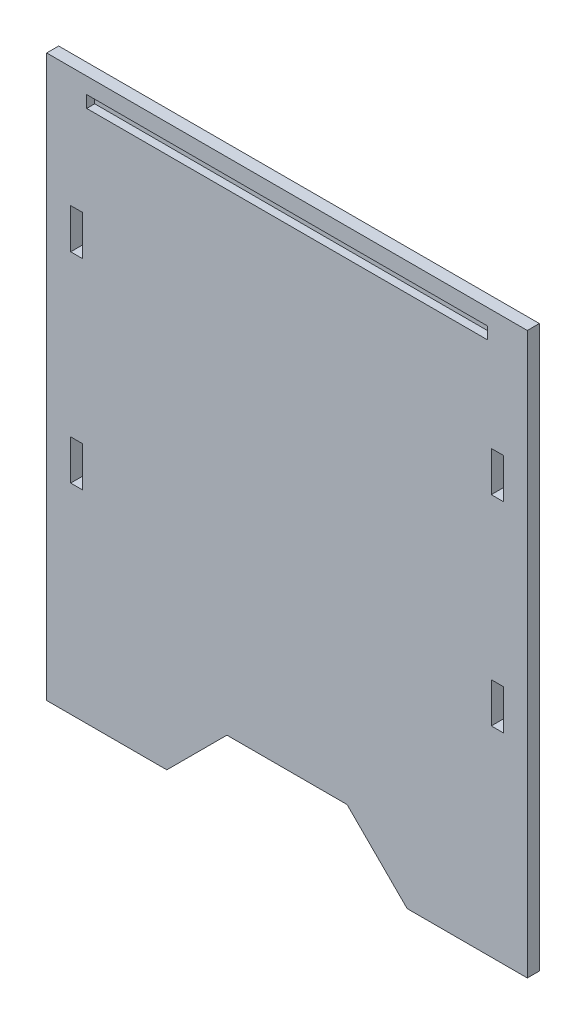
ISO-10303-21;
HEADER;
FILE_DESCRIPTION(('STEP AP214'),'2;1');
FILE_NAME('part.step','',(''),(''),'','','');
FILE_SCHEMA(('AUTOMOTIVE_DESIGN { 1 0 10303 214 1 1 1 1 }'));
ENDSEC;
DATA;
#1=APPLICATION_CONTEXT('core data for automotive mechanical design processes');
#2=APPLICATION_PROTOCOL_DEFINITION('international standard','automotive_design',2000,#1);
#3=PRODUCT_CONTEXT('',#1,'mechanical');
#4=PRODUCT('Part','Part','',(#3));
#5=PRODUCT_RELATED_PRODUCT_CATEGORY('part','',(#4));
#6=PRODUCT_DEFINITION_FORMATION('','',#4);
#7=PRODUCT_DEFINITION_CONTEXT('part definition',#1,'design');
#8=PRODUCT_DEFINITION('design','',#6,#7);
#9=PRODUCT_DEFINITION_SHAPE('','',#8);
#10=(LENGTH_UNIT() NAMED_UNIT(*) SI_UNIT(.MILLI.,.METRE.));
#11=(NAMED_UNIT(*) PLANE_ANGLE_UNIT() SI_UNIT($,.RADIAN.));
#12=(NAMED_UNIT(*) SI_UNIT($,.STERADIAN.) SOLID_ANGLE_UNIT());
#13=UNCERTAINTY_MEASURE_WITH_UNIT(LENGTH_MEASURE(1.E-05),#10,'distance_accuracy_value','');
#14=(GEOMETRIC_REPRESENTATION_CONTEXT(3) GLOBAL_UNCERTAINTY_ASSIGNED_CONTEXT((#13)) GLOBAL_UNIT_ASSIGNED_CONTEXT((#10,
#11,#12)) REPRESENTATION_CONTEXT('',''));
#15=CARTESIAN_POINT('',(0.,0.,0.));
#16=DIRECTION('',(0.,0.,1.));
#17=DIRECTION('',(1.,0.,0.));
#18=AXIS2_PLACEMENT_3D('',#15,#16,#17);
#19=CARTESIAN_POINT('',(300.,-350.,15.));
#20=DIRECTION('',(-1.,0.,0.));
#21=DIRECTION('',(0.,0.,1.));
#22=AXIS2_PLACEMENT_3D('',#19,#20,#21);
#23=PLANE('',#22);
#24=DIRECTION('',(0.,1.,0.));
#25=VECTOR('',#24,1.);
#26=CARTESIAN_POINT('',(300.,-350.,0.));
#27=LINE('',#26,#25);
#28=CARTESIAN_POINT('',(300.,-350.,0.));
#29=VERTEX_POINT('',#28);
#30=CARTESIAN_POINT('',(300.,350.,0.));
#31=VERTEX_POINT('',#30);
#32=EDGE_CURVE('E438',#29,#31,#27,.T.);
#33=ORIENTED_EDGE('',*,*,#32,.T.);
#34=DIRECTION('',(0.,0.,-1.));
#35=VECTOR('',#34,1.);
#36=CARTESIAN_POINT('',(300.,350.,15.));
#37=LINE('',#36,#35);
#38=CARTESIAN_POINT('',(300.,350.,15.));
#39=VERTEX_POINT('',#38);
#40=EDGE_CURVE('E11',#39,#31,#37,.T.);
#41=ORIENTED_EDGE('',*,*,#40,.F.);
#42=DIRECTION('',(0.,1.,0.));
#43=VECTOR('',#42,1.);
#44=CARTESIAN_POINT('',(300.,-350.,15.));
#45=LINE('',#44,#43);
#46=CARTESIAN_POINT('',(300.,-350.,15.));
#47=VERTEX_POINT('',#46);
#48=EDGE_CURVE('E448',#47,#39,#45,.T.);
#49=ORIENTED_EDGE('',*,*,#48,.F.);
#50=DIRECTION('',(0.,0.,-1.));
#51=VECTOR('',#50,1.);
#52=CARTESIAN_POINT('',(300.,-350.,15.));
#53=LINE('',#52,#51);
#54=EDGE_CURVE('E474',#47,#29,#53,.T.);
#55=ORIENTED_EDGE('',*,*,#54,.T.);
#56=EDGE_LOOP('',(#33,#41,#49,#55));
#57=FACE_BOUND('',#56,.T.);
#58=ADVANCED_FACE('F43',(#57),#23,.F.);
#59=CARTESIAN_POINT('',(-300.,350.,15.));
#60=DIRECTION('',(0.,-1.,0.));
#61=DIRECTION('',(0.,0.,-1.));
#62=AXIS2_PLACEMENT_3D('',#59,#60,#61);
#63=PLANE('',#62);
#64=DIRECTION('',(-1.,0.,0.));
#65=VECTOR('',#64,1.);
#66=CARTESIAN_POINT('',(-300.,350.,0.));
#67=LINE('',#66,#65);
#68=CARTESIAN_POINT('',(-300.,350.,0.));
#69=VERTEX_POINT('',#68);
#70=EDGE_CURVE('E478',#31,#69,#67,.T.);
#71=ORIENTED_EDGE('',*,*,#70,.T.);
#72=DIRECTION('',(0.,0.,-1.));
#73=VECTOR('',#72,1.);
#74=CARTESIAN_POINT('',(-300.,350.,15.));
#75=LINE('',#74,#73);
#76=CARTESIAN_POINT('',(-300.,350.,15.));
#77=VERTEX_POINT('',#76);
#78=EDGE_CURVE('E51',#77,#69,#75,.T.);
#79=ORIENTED_EDGE('',*,*,#78,.F.);
#80=DIRECTION('',(-1.,0.,0.));
#81=VECTOR('',#80,1.);
#82=CARTESIAN_POINT('',(-300.,350.,15.));
#83=LINE('',#82,#81);
#84=EDGE_CURVE('E452',#39,#77,#83,.T.);
#85=ORIENTED_EDGE('',*,*,#84,.F.);
#86=ORIENTED_EDGE('',*,*,#40,.T.);
#87=EDGE_LOOP('',(#71,#79,#85,#86));
#88=FACE_BOUND('',#87,.T.);
#89=ADVANCED_FACE('F548',(#88),#63,.F.);
#90=CARTESIAN_POINT('',(-300.,-350.,15.));
#91=DIRECTION('',(1.,0.,0.));
#92=DIRECTION('',(0.,0.,-1.));
#93=AXIS2_PLACEMENT_3D('',#90,#91,#92);
#94=PLANE('',#93);
#95=DIRECTION('',(0.,-1.,0.));
#96=VECTOR('',#95,1.);
#97=CARTESIAN_POINT('',(-300.,-350.,0.));
#98=LINE('',#97,#96);
#99=CARTESIAN_POINT('',(-300.,-350.,0.));
#100=VERTEX_POINT('',#99);
#101=EDGE_CURVE('E481',#69,#100,#98,.T.);
#102=ORIENTED_EDGE('',*,*,#101,.T.);
#103=DIRECTION('',(0.,0.,-1.));
#104=VECTOR('',#103,1.);
#105=CARTESIAN_POINT('',(-300.,-350.,15.));
#106=LINE('',#105,#104);
#107=CARTESIAN_POINT('',(-300.,-350.,15.));
#108=VERTEX_POINT('',#107);
#109=EDGE_CURVE('E517',#108,#100,#106,.T.);
#110=ORIENTED_EDGE('',*,*,#109,.F.);
#111=DIRECTION('',(0.,-1.,0.));
#112=VECTOR('',#111,1.);
#113=CARTESIAN_POINT('',(-300.,-350.,15.));
#114=LINE('',#113,#112);
#115=EDGE_CURVE('E456',#77,#108,#114,.T.);
#116=ORIENTED_EDGE('',*,*,#115,.F.);
#117=ORIENTED_EDGE('',*,*,#78,.T.);
#118=EDGE_LOOP('',(#102,#110,#116,#117));
#119=FACE_BOUND('',#118,.T.);
#120=ADVANCED_FACE('F526',(#119),#94,.F.);
#121=CARTESIAN_POINT('',(-300.,-350.,15.));
#122=DIRECTION('',(0.,1.,0.));
#123=DIRECTION('',(0.,0.,1.));
#124=AXIS2_PLACEMENT_3D('',#121,#122,#123);
#125=PLANE('',#124);
#126=DIRECTION('',(1.,0.,0.));
#127=VECTOR('',#126,1.);
#128=CARTESIAN_POINT('',(-300.,-350.,0.));
#129=LINE('',#128,#127);
#130=CARTESIAN_POINT('',(-150.,-350.,0.));
#131=VERTEX_POINT('',#130);
#132=EDGE_CURVE('E484',#100,#131,#129,.T.);
#133=ORIENTED_EDGE('',*,*,#132,.T.);
#134=DIRECTION('',(0.,0.,-1.));
#135=VECTOR('',#134,1.);
#136=CARTESIAN_POINT('',(-150.,-350.,15.));
#137=LINE('',#136,#135);
#138=CARTESIAN_POINT('',(-150.,-350.,15.));
#139=VERTEX_POINT('',#138);
#140=EDGE_CURVE('E513',#139,#131,#137,.T.);
#141=ORIENTED_EDGE('',*,*,#140,.F.);
#142=DIRECTION('',(1.,0.,0.));
#143=VECTOR('',#142,1.);
#144=CARTESIAN_POINT('',(-300.,-350.,15.));
#145=LINE('',#144,#143);
#146=EDGE_CURVE('E459',#108,#139,#145,.T.);
#147=ORIENTED_EDGE('',*,*,#146,.F.);
#148=ORIENTED_EDGE('',*,*,#109,.T.);
#149=EDGE_LOOP('',(#133,#141,#147,#148));
#150=FACE_BOUND('',#149,.T.);
#151=ADVANCED_FACE('F537',(#150),#125,.F.);
#152=CARTESIAN_POINT('',(-150.,-350.,15.));
#153=DIRECTION('',(-0.707106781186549,0.707106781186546,0.));
#154=DIRECTION('',(-0.707106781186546,-0.707106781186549,0.));
#155=AXIS2_PLACEMENT_3D('',#152,#153,#154);
#156=PLANE('',#155);
#157=DIRECTION('',(0.707106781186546,0.707106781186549,0.));
#158=VECTOR('',#157,1.);
#159=CARTESIAN_POINT('',(-150.,-350.,0.));
#160=LINE('',#159,#158);
#161=CARTESIAN_POINT('',(-75.0000000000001,-275.,0.));
#162=VERTEX_POINT('',#161);
#163=EDGE_CURVE('E487',#131,#162,#160,.T.);
#164=ORIENTED_EDGE('',*,*,#163,.T.);
#165=DIRECTION('',(0.,0.,-1.));
#166=VECTOR('',#165,1.);
#167=CARTESIAN_POINT('',(-75.0000000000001,-275.,15.));
#168=LINE('',#167,#166);
#169=CARTESIAN_POINT('',(-75.0000000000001,-275.,15.));
#170=VERTEX_POINT('',#169);
#171=EDGE_CURVE('E509',#170,#162,#168,.T.);
#172=ORIENTED_EDGE('',*,*,#171,.F.);
#173=DIRECTION('',(0.707106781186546,0.707106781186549,0.));
#174=VECTOR('',#173,1.);
#175=CARTESIAN_POINT('',(-150.,-350.,15.));
#176=LINE('',#175,#174);
#177=EDGE_CURVE('E462',#139,#170,#176,.T.);
#178=ORIENTED_EDGE('',*,*,#177,.F.);
#179=ORIENTED_EDGE('',*,*,#140,.T.);
#180=EDGE_LOOP('',(#164,#172,#178,#179));
#181=FACE_BOUND('',#180,.T.);
#182=ADVANCED_FACE('F541',(#181),#156,.F.);
#183=CARTESIAN_POINT('',(-75.0000000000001,-275.,15.));
#184=DIRECTION('',(0.,1.,0.));
#185=DIRECTION('',(-1.,0.,0.));
#186=AXIS2_PLACEMENT_3D('',#183,#184,#185);
#187=PLANE('',#186);
#188=DIRECTION('',(1.,0.,0.));
#189=VECTOR('',#188,1.);
#190=CARTESIAN_POINT('',(-75.0000000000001,-275.,0.));
#191=LINE('',#190,#189);
#192=CARTESIAN_POINT('',(74.9999999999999,-275.,0.));
#193=VERTEX_POINT('',#192);
#194=EDGE_CURVE('E490',#162,#193,#191,.T.);
#195=ORIENTED_EDGE('',*,*,#194,.T.);
#196=DIRECTION('',(0.,0.,-1.));
#197=VECTOR('',#196,1.);
#198=CARTESIAN_POINT('',(74.9999999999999,-275.,15.));
#199=LINE('',#198,#197);
#200=CARTESIAN_POINT('',(74.9999999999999,-275.,15.));
#201=VERTEX_POINT('',#200);
#202=EDGE_CURVE('E505',#201,#193,#199,.T.);
#203=ORIENTED_EDGE('',*,*,#202,.F.);
#204=DIRECTION('',(1.,0.,0.));
#205=VECTOR('',#204,1.);
#206=CARTESIAN_POINT('',(-75.0000000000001,-275.,15.));
#207=LINE('',#206,#205);
#208=EDGE_CURVE('E465',#170,#201,#207,.T.);
#209=ORIENTED_EDGE('',*,*,#208,.F.);
#210=ORIENTED_EDGE('',*,*,#171,.T.);
#211=EDGE_LOOP('',(#195,#203,#209,#210));
#212=FACE_BOUND('',#211,.T.);
#213=ADVANCED_FACE('F561',(#212),#187,.F.);
#214=CARTESIAN_POINT('',(74.9999999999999,-275.,15.));
#215=DIRECTION('',(0.707106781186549,0.707106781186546,0.));
#216=DIRECTION('',(-0.707106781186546,0.707106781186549,0.));
#217=AXIS2_PLACEMENT_3D('',#214,#215,#216);
#218=PLANE('',#217);
#219=DIRECTION('',(0.707106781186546,-0.707106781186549,0.));
#220=VECTOR('',#219,1.);
#221=CARTESIAN_POINT('',(74.9999999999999,-275.,0.));
#222=LINE('',#221,#220);
#223=CARTESIAN_POINT('',(150.,-350.,0.));
#224=VERTEX_POINT('',#223);
#225=EDGE_CURVE('E493',#193,#224,#222,.T.);
#226=ORIENTED_EDGE('',*,*,#225,.T.);
#227=DIRECTION('',(0.,0.,-1.));
#228=VECTOR('',#227,1.);
#229=CARTESIAN_POINT('',(150.,-350.,15.));
#230=LINE('',#229,#228);
#231=CARTESIAN_POINT('',(150.,-350.,15.));
#232=VERTEX_POINT('',#231);
#233=EDGE_CURVE('E501',#232,#224,#230,.T.);
#234=ORIENTED_EDGE('',*,*,#233,.F.);
#235=DIRECTION('',(0.707106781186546,-0.707106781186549,0.));
#236=VECTOR('',#235,1.);
#237=CARTESIAN_POINT('',(74.9999999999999,-275.,15.));
#238=LINE('',#237,#236);
#239=EDGE_CURVE('E468',#201,#232,#238,.T.);
#240=ORIENTED_EDGE('',*,*,#239,.F.);
#241=ORIENTED_EDGE('',*,*,#202,.T.);
#242=EDGE_LOOP('',(#226,#234,#240,#241));
#243=FACE_BOUND('',#242,.T.);
#244=ADVANCED_FACE('F559',(#243),#218,.F.);
#245=CARTESIAN_POINT('',(150.,-350.,15.));
#246=DIRECTION('',(0.,1.,0.));
#247=DIRECTION('',(0.,0.,1.));
#248=AXIS2_PLACEMENT_3D('',#245,#246,#247);
#249=PLANE('',#248);
#250=DIRECTION('',(1.,0.,0.));
#251=VECTOR('',#250,1.);
#252=CARTESIAN_POINT('',(150.,-350.,0.));
#253=LINE('',#252,#251);
#254=EDGE_CURVE('E453',#224,#29,#253,.T.);
#255=ORIENTED_EDGE('',*,*,#254,.T.);
#256=ORIENTED_EDGE('',*,*,#54,.F.);
#257=DIRECTION('',(1.,0.,0.));
#258=VECTOR('',#257,1.);
#259=CARTESIAN_POINT('',(150.,-350.,15.));
#260=LINE('',#259,#258);
#261=EDGE_CURVE('E471',#232,#47,#260,.T.);
#262=ORIENTED_EDGE('',*,*,#261,.F.);
#263=ORIENTED_EDGE('',*,*,#233,.T.);
#264=EDGE_LOOP('',(#255,#256,#262,#263));
#265=FACE_BOUND('',#264,.T.);
#266=ADVANCED_FACE('F554',(#265),#249,.F.);
#267=CARTESIAN_POINT('',(0.,0.,15.));
#268=DIRECTION('',(0.,0.,-1.));
#269=DIRECTION('',(-1.,0.,0.));
#270=AXIS2_PLACEMENT_3D('',#267,#268,#269);
#271=PLANE('',#270);
#272=DIRECTION('',(-1.,0.,0.));
#273=VECTOR('',#272,1.);
#274=CARTESIAN_POINT('',(255.,-50.,15.));
#275=LINE('',#274,#273);
#276=CARTESIAN_POINT('',(270.,-50.,15.));
#277=VERTEX_POINT('',#276);
#278=CARTESIAN_POINT('',(255.,-50.,15.));
#279=VERTEX_POINT('',#278);
#280=EDGE_CURVE('E301',#277,#279,#275,.T.);
#281=ORIENTED_EDGE('',*,*,#280,.F.);
#282=DIRECTION('',(0.,1.,0.));
#283=VECTOR('',#282,1.);
#284=CARTESIAN_POINT('',(270.,-100.,15.));
#285=LINE('',#284,#283);
#286=CARTESIAN_POINT('',(270.,-100.,15.));
#287=VERTEX_POINT('',#286);
#288=EDGE_CURVE('E58',#287,#277,#285,.T.);
#289=ORIENTED_EDGE('',*,*,#288,.F.);
#290=DIRECTION('',(1.,0.,0.));
#291=VECTOR('',#290,1.);
#292=CARTESIAN_POINT('',(255.,-100.,15.));
#293=LINE('',#292,#291);
#294=CARTESIAN_POINT('',(255.,-100.,15.));
#295=VERTEX_POINT('',#294);
#296=EDGE_CURVE('E292',#295,#287,#293,.T.);
#297=ORIENTED_EDGE('',*,*,#296,.F.);
#298=DIRECTION('',(0.,-1.,0.));
#299=VECTOR('',#298,1.);
#300=CARTESIAN_POINT('',(255.,-100.,15.));
#301=LINE('',#300,#299);
#302=EDGE_CURVE('E296',#279,#295,#301,.T.);
#303=ORIENTED_EDGE('',*,*,#302,.F.);
#304=EDGE_LOOP('',(#281,#289,#297,#303));
#305=FACE_BOUND('',#304,.T.);
#306=DIRECTION('',(1.,0.,0.));
#307=VECTOR('',#306,1.);
#308=CARTESIAN_POINT('',(-255.5,150.,15.));
#309=LINE('',#308,#307);
#310=CARTESIAN_POINT('',(-270.,150.,15.));
#311=VERTEX_POINT('',#310);
#312=CARTESIAN_POINT('',(-255.5,150.,15.));
#313=VERTEX_POINT('',#312);
#314=EDGE_CURVE('E340',#311,#313,#309,.T.);
#315=ORIENTED_EDGE('',*,*,#314,.F.);
#316=DIRECTION('',(0.,-1.,0.));
#317=VECTOR('',#316,1.);
#318=CARTESIAN_POINT('',(-270.,150.,15.));
#319=LINE('',#318,#317);
#320=CARTESIAN_POINT('',(-270.,200.,15.));
#321=VERTEX_POINT('',#320);
#322=EDGE_CURVE('E66',#321,#311,#319,.T.);
#323=ORIENTED_EDGE('',*,*,#322,.F.);
#324=DIRECTION('',(-1.,0.,0.));
#325=VECTOR('',#324,1.);
#326=CARTESIAN_POINT('',(-255.5,200.,15.));
#327=LINE('',#326,#325);
#328=CARTESIAN_POINT('',(-255.5,200.,15.));
#329=VERTEX_POINT('',#328);
#330=EDGE_CURVE('E331',#329,#321,#327,.T.);
#331=ORIENTED_EDGE('',*,*,#330,.F.);
#332=DIRECTION('',(0.,1.,0.));
#333=VECTOR('',#332,1.);
#334=CARTESIAN_POINT('',(-255.5,150.,15.));
#335=LINE('',#334,#333);
#336=EDGE_CURVE('E335',#313,#329,#335,.T.);
#337=ORIENTED_EDGE('',*,*,#336,.F.);
#338=EDGE_LOOP('',(#315,#323,#331,#337));
#339=FACE_BOUND('',#338,.T.);
#340=DIRECTION('',(1.,0.,0.));
#341=VECTOR('',#340,1.);
#342=CARTESIAN_POINT('',(-255.5,-100.,15.));
#343=LINE('',#342,#341);
#344=CARTESIAN_POINT('',(-270.,-100.,15.));
#345=VERTEX_POINT('',#344);
#346=CARTESIAN_POINT('',(-255.5,-100.,15.));
#347=VERTEX_POINT('',#346);
#348=EDGE_CURVE('E254',#345,#347,#343,.T.);
#349=ORIENTED_EDGE('',*,*,#348,.F.);
#350=DIRECTION('',(0.,-1.,0.));
#351=VECTOR('',#350,1.);
#352=CARTESIAN_POINT('',(-270.,-100.,15.));
#353=LINE('',#352,#351);
#354=CARTESIAN_POINT('',(-270.,-50.,15.));
#355=VERTEX_POINT('',#354);
#356=EDGE_CURVE('E231',#355,#345,#353,.T.);
#357=ORIENTED_EDGE('',*,*,#356,.F.);
#358=DIRECTION('',(-1.,0.,0.));
#359=VECTOR('',#358,1.);
#360=CARTESIAN_POINT('',(-255.5,-50.,15.));
#361=LINE('',#360,#359);
#362=CARTESIAN_POINT('',(-255.5,-50.,15.));
#363=VERTEX_POINT('',#362);
#364=EDGE_CURVE('E242',#363,#355,#361,.T.);
#365=ORIENTED_EDGE('',*,*,#364,.F.);
#366=DIRECTION('',(0.,1.,0.));
#367=VECTOR('',#366,1.);
#368=CARTESIAN_POINT('',(-255.5,-100.,15.));
#369=LINE('',#368,#367);
#370=EDGE_CURVE('E248',#347,#363,#369,.T.);
#371=ORIENTED_EDGE('',*,*,#370,.F.);
#372=EDGE_LOOP('',(#349,#357,#365,#371));
#373=FACE_BOUND('',#372,.T.);
#374=DIRECTION('',(-1.,0.,0.));
#375=VECTOR('',#374,1.);
#376=CARTESIAN_POINT('',(255.,200.,15.));
#377=LINE('',#376,#375);
#378=CARTESIAN_POINT('',(270.,200.,15.));
#379=VERTEX_POINT('',#378);
#380=CARTESIAN_POINT('',(255.,200.,15.));
#381=VERTEX_POINT('',#380);
#382=EDGE_CURVE('E380',#379,#381,#377,.T.);
#383=ORIENTED_EDGE('',*,*,#382,.F.);
#384=DIRECTION('',(0.,1.,0.));
#385=VECTOR('',#384,1.);
#386=CARTESIAN_POINT('',(270.,150.,15.));
#387=LINE('',#386,#385);
#388=CARTESIAN_POINT('',(270.,150.,15.));
#389=VERTEX_POINT('',#388);
#390=EDGE_CURVE('E307',#389,#379,#387,.T.);
#391=ORIENTED_EDGE('',*,*,#390,.F.);
#392=DIRECTION('',(1.,0.,0.));
#393=VECTOR('',#392,1.);
#394=CARTESIAN_POINT('',(255.,150.,15.));
#395=LINE('',#394,#393);
#396=CARTESIAN_POINT('',(255.,150.,15.));
#397=VERTEX_POINT('',#396);
#398=EDGE_CURVE('E365',#397,#389,#395,.T.);
#399=ORIENTED_EDGE('',*,*,#398,.F.);
#400=DIRECTION('',(0.,-1.,0.));
#401=VECTOR('',#400,1.);
#402=CARTESIAN_POINT('',(255.,150.,15.));
#403=LINE('',#402,#401);
#404=EDGE_CURVE('E384',#381,#397,#403,.T.);
#405=ORIENTED_EDGE('',*,*,#404,.F.);
#406=EDGE_LOOP('',(#383,#391,#399,#405));
#407=FACE_BOUND('',#406,.T.);
#408=DIRECTION('',(-1.,0.,0.));
#409=VECTOR('',#408,1.);
#410=CARTESIAN_POINT('',(-250.,330.,15.));
#411=LINE('',#410,#409);
#412=CARTESIAN_POINT('',(250.,330.,15.));
#413=VERTEX_POINT('',#412);
#414=CARTESIAN_POINT('',(-250.,330.,15.));
#415=VERTEX_POINT('',#414);
#416=EDGE_CURVE('E424',#413,#415,#411,.T.);
#417=ORIENTED_EDGE('',*,*,#416,.F.);
#418=DIRECTION('',(0.,1.,0.));
#419=VECTOR('',#418,1.);
#420=CARTESIAN_POINT('',(250.,315.,15.));
#421=LINE('',#420,#419);
#422=CARTESIAN_POINT('',(250.,315.,15.));
#423=VERTEX_POINT('',#422);
#424=EDGE_CURVE('E394',#423,#413,#421,.T.);
#425=ORIENTED_EDGE('',*,*,#424,.F.);
#426=DIRECTION('',(1.,0.,0.));
#427=VECTOR('',#426,1.);
#428=CARTESIAN_POINT('',(-250.,315.,15.));
#429=LINE('',#428,#427);
#430=CARTESIAN_POINT('',(-250.,315.,15.));
#431=VERTEX_POINT('',#430);
#432=EDGE_CURVE('E409',#431,#423,#429,.T.);
#433=ORIENTED_EDGE('',*,*,#432,.F.);
#434=DIRECTION('',(0.,-1.,0.));
#435=VECTOR('',#434,1.);
#436=CARTESIAN_POINT('',(-250.,315.,15.));
#437=LINE('',#436,#435);
#438=EDGE_CURVE('E428',#415,#431,#437,.T.);
#439=ORIENTED_EDGE('',*,*,#438,.F.);
#440=EDGE_LOOP('',(#417,#425,#433,#439));
#441=FACE_BOUND('',#440,.T.);
#442=ORIENTED_EDGE('',*,*,#48,.T.);
#443=ORIENTED_EDGE('',*,*,#84,.T.);
#444=ORIENTED_EDGE('',*,*,#115,.T.);
#445=ORIENTED_EDGE('',*,*,#146,.T.);
#446=ORIENTED_EDGE('',*,*,#177,.T.);
#447=ORIENTED_EDGE('',*,*,#208,.T.);
#448=ORIENTED_EDGE('',*,*,#239,.T.);
#449=ORIENTED_EDGE('',*,*,#261,.T.);
#450=EDGE_LOOP('',(#442,#443,#444,#445,#446,#447,#448,#449));
#451=FACE_BOUND('',#450,.T.);
#452=ADVANCED_FACE('F251',(#305,#339,#373,#407,#441,#451),#271,.F.);
#453=CARTESIAN_POINT('',(0.,0.,0.));
#454=DIRECTION('',(0.,0.,-1.));
#455=DIRECTION('',(-1.,0.,0.));
#456=AXIS2_PLACEMENT_3D('',#453,#454,#455);
#457=PLANE('',#456);
#458=DIRECTION('',(0.,1.,0.));
#459=VECTOR('',#458,1.);
#460=CARTESIAN_POINT('',(270.,-100.,0.));
#461=LINE('',#460,#459);
#462=CARTESIAN_POINT('',(270.,-100.,0.));
#463=VERTEX_POINT('',#462);
#464=CARTESIAN_POINT('',(270.,-50.,0.));
#465=VERTEX_POINT('',#464);
#466=EDGE_CURVE('E297',#463,#465,#461,.T.);
#467=ORIENTED_EDGE('',*,*,#466,.T.);
#468=DIRECTION('',(-1.,0.,0.));
#469=VECTOR('',#468,1.);
#470=CARTESIAN_POINT('',(255.,-50.,0.));
#471=LINE('',#470,#469);
#472=CARTESIAN_POINT('',(255.,-50.,0.));
#473=VERTEX_POINT('',#472);
#474=EDGE_CURVE('E315',#465,#473,#471,.T.);
#475=ORIENTED_EDGE('',*,*,#474,.T.);
#476=DIRECTION('',(0.,-1.,0.));
#477=VECTOR('',#476,1.);
#478=CARTESIAN_POINT('',(255.,-100.,0.));
#479=LINE('',#478,#477);
#480=CARTESIAN_POINT('',(255.,-100.,0.));
#481=VERTEX_POINT('',#480);
#482=EDGE_CURVE('E311',#473,#481,#479,.T.);
#483=ORIENTED_EDGE('',*,*,#482,.T.);
#484=DIRECTION('',(1.,0.,0.));
#485=VECTOR('',#484,1.);
#486=CARTESIAN_POINT('',(255.,-100.,0.));
#487=LINE('',#486,#485);
#488=EDGE_CURVE('E282',#481,#463,#487,.T.);
#489=ORIENTED_EDGE('',*,*,#488,.T.);
#490=EDGE_LOOP('',(#467,#475,#483,#489));
#491=FACE_BOUND('',#490,.T.);
#492=DIRECTION('',(0.,-1.,0.));
#493=VECTOR('',#492,1.);
#494=CARTESIAN_POINT('',(-270.,150.,0.));
#495=LINE('',#494,#493);
#496=CARTESIAN_POINT('',(-270.,200.,0.));
#497=VERTEX_POINT('',#496);
#498=CARTESIAN_POINT('',(-270.,150.,0.));
#499=VERTEX_POINT('',#498);
#500=EDGE_CURVE('E336',#497,#499,#495,.T.);
#501=ORIENTED_EDGE('',*,*,#500,.T.);
#502=DIRECTION('',(1.,0.,0.));
#503=VECTOR('',#502,1.);
#504=CARTESIAN_POINT('',(-255.5,150.,0.));
#505=LINE('',#504,#503);
#506=CARTESIAN_POINT('',(-255.5,150.,0.));
#507=VERTEX_POINT('',#506);
#508=EDGE_CURVE('E353',#499,#507,#505,.T.);
#509=ORIENTED_EDGE('',*,*,#508,.T.);
#510=DIRECTION('',(0.,1.,0.));
#511=VECTOR('',#510,1.);
#512=CARTESIAN_POINT('',(-255.5,150.,0.));
#513=LINE('',#512,#511);
#514=CARTESIAN_POINT('',(-255.5,200.,0.));
#515=VERTEX_POINT('',#514);
#516=EDGE_CURVE('E349',#507,#515,#513,.T.);
#517=ORIENTED_EDGE('',*,*,#516,.T.);
#518=DIRECTION('',(-1.,0.,0.));
#519=VECTOR('',#518,1.);
#520=CARTESIAN_POINT('',(-255.5,200.,0.));
#521=LINE('',#520,#519);
#522=EDGE_CURVE('E325',#515,#497,#521,.T.);
#523=ORIENTED_EDGE('',*,*,#522,.T.);
#524=EDGE_LOOP('',(#501,#509,#517,#523));
#525=FACE_BOUND('',#524,.T.);
#526=DIRECTION('',(0.,-1.,0.));
#527=VECTOR('',#526,1.);
#528=CARTESIAN_POINT('',(-270.,-100.,0.));
#529=LINE('',#528,#527);
#530=CARTESIAN_POINT('',(-270.,-50.,0.));
#531=VERTEX_POINT('',#530);
#532=CARTESIAN_POINT('',(-270.,-100.,0.));
#533=VERTEX_POINT('',#532);
#534=EDGE_CURVE('E234',#531,#533,#529,.T.);
#535=ORIENTED_EDGE('',*,*,#534,.T.);
#536=DIRECTION('',(1.,0.,0.));
#537=VECTOR('',#536,1.);
#538=CARTESIAN_POINT('',(-255.5,-100.,0.));
#539=LINE('',#538,#537);
#540=CARTESIAN_POINT('',(-255.5,-100.,0.));
#541=VERTEX_POINT('',#540);
#542=EDGE_CURVE('E273',#533,#541,#539,.T.);
#543=ORIENTED_EDGE('',*,*,#542,.T.);
#544=DIRECTION('',(0.,1.,0.));
#545=VECTOR('',#544,1.);
#546=CARTESIAN_POINT('',(-255.5,-100.,0.));
#547=LINE('',#546,#545);
#548=CARTESIAN_POINT('',(-255.5,-50.,0.));
#549=VERTEX_POINT('',#548);
#550=EDGE_CURVE('E268',#541,#549,#547,.T.);
#551=ORIENTED_EDGE('',*,*,#550,.T.);
#552=DIRECTION('',(-1.,0.,0.));
#553=VECTOR('',#552,1.);
#554=CARTESIAN_POINT('',(-255.5,-50.,0.));
#555=LINE('',#554,#553);
#556=EDGE_CURVE('E265',#549,#531,#555,.T.);
#557=ORIENTED_EDGE('',*,*,#556,.T.);
#558=EDGE_LOOP('',(#535,#543,#551,#557));
#559=FACE_BOUND('',#558,.T.);
#560=DIRECTION('',(0.,1.,0.));
#561=VECTOR('',#560,1.);
#562=CARTESIAN_POINT('',(270.,150.,0.));
#563=LINE('',#562,#561);
#564=CARTESIAN_POINT('',(270.,150.,0.));
#565=VERTEX_POINT('',#564);
#566=CARTESIAN_POINT('',(270.,200.,0.));
#567=VERTEX_POINT('',#566);
#568=EDGE_CURVE('E360',#565,#567,#563,.T.);
#569=ORIENTED_EDGE('',*,*,#568,.T.);
#570=DIRECTION('',(-1.,0.,0.));
#571=VECTOR('',#570,1.);
#572=CARTESIAN_POINT('',(255.,200.,0.));
#573=LINE('',#572,#571);
#574=CARTESIAN_POINT('',(255.,200.,0.));
#575=VERTEX_POINT('',#574);
#576=EDGE_CURVE('E364',#567,#575,#573,.T.);
#577=ORIENTED_EDGE('',*,*,#576,.T.);
#578=DIRECTION('',(0.,-1.,0.));
#579=VECTOR('',#578,1.);
#580=CARTESIAN_POINT('',(255.,150.,0.));
#581=LINE('',#580,#579);
#582=CARTESIAN_POINT('',(255.,150.,0.));
#583=VERTEX_POINT('',#582);
#584=EDGE_CURVE('E369',#575,#583,#581,.T.);
#585=ORIENTED_EDGE('',*,*,#584,.T.);
#586=DIRECTION('',(1.,0.,0.));
#587=VECTOR('',#586,1.);
#588=CARTESIAN_POINT('',(255.,150.,0.));
#589=LINE('',#588,#587);
#590=EDGE_CURVE('E373',#583,#565,#589,.T.);
#591=ORIENTED_EDGE('',*,*,#590,.T.);
#592=EDGE_LOOP('',(#569,#577,#585,#591));
#593=FACE_BOUND('',#592,.T.);
#594=ORIENTED_EDGE('',*,*,#32,.F.);
#595=ORIENTED_EDGE('',*,*,#254,.F.);
#596=ORIENTED_EDGE('',*,*,#225,.F.);
#597=ORIENTED_EDGE('',*,*,#194,.F.);
#598=ORIENTED_EDGE('',*,*,#163,.F.);
#599=ORIENTED_EDGE('',*,*,#132,.F.);
#600=ORIENTED_EDGE('',*,*,#101,.F.);
#601=ORIENTED_EDGE('',*,*,#70,.F.);
#602=EDGE_LOOP('',(#594,#595,#596,#597,#598,#599,#600,#601));
#603=FACE_BOUND('',#602,.T.);
#604=ADVANCED_FACE('F532',(#491,#525,#559,#593,#603),#457,.T.);
#605=CARTESIAN_POINT('',(250.,315.,5.));
#606=DIRECTION('',(1.,0.,0.));
#607=DIRECTION('',(0.,0.,-1.));
#608=AXIS2_PLACEMENT_3D('',#605,#606,#607);
#609=PLANE('',#608);
#610=ORIENTED_EDGE('',*,*,#424,.T.);
#611=DIRECTION('',(0.,0.,1.));
#612=VECTOR('',#611,1.);
#613=CARTESIAN_POINT('',(250.,330.,5.));
#614=LINE('',#613,#612);
#615=CARTESIAN_POINT('',(250.,330.,5.));
#616=VERTEX_POINT('',#615);
#617=EDGE_CURVE('E421',#616,#413,#614,.T.);
#618=ORIENTED_EDGE('',*,*,#617,.F.);
#619=DIRECTION('',(0.,1.,0.));
#620=VECTOR('',#619,1.);
#621=CARTESIAN_POINT('',(250.,315.,5.));
#622=LINE('',#621,#620);
#623=CARTESIAN_POINT('',(250.,315.,5.));
#624=VERTEX_POINT('',#623);
#625=EDGE_CURVE('E404',#624,#616,#622,.T.);
#626=ORIENTED_EDGE('',*,*,#625,.F.);
#627=DIRECTION('',(0.,0.,1.));
#628=VECTOR('',#627,1.);
#629=CARTESIAN_POINT('',(250.,315.,5.));
#630=LINE('',#629,#628);
#631=EDGE_CURVE('E435',#624,#423,#630,.T.);
#632=ORIENTED_EDGE('',*,*,#631,.T.);
#633=EDGE_LOOP('',(#610,#618,#626,#632));
#634=FACE_BOUND('',#633,.T.);
#635=ADVANCED_FACE('F617',(#634),#609,.F.);
#636=CARTESIAN_POINT('',(-250.,315.,5.));
#637=DIRECTION('',(0.,-1.,0.));
#638=DIRECTION('',(0.,0.,-1.));
#639=AXIS2_PLACEMENT_3D('',#636,#637,#638);
#640=PLANE('',#639);
#641=ORIENTED_EDGE('',*,*,#432,.T.);
#642=ORIENTED_EDGE('',*,*,#631,.F.);
#643=DIRECTION('',(1.,0.,0.));
#644=VECTOR('',#643,1.);
#645=CARTESIAN_POINT('',(-250.,315.,5.));
#646=LINE('',#645,#644);
#647=CARTESIAN_POINT('',(-250.,315.,5.));
#648=VERTEX_POINT('',#647);
#649=EDGE_CURVE('E417',#648,#624,#646,.T.);
#650=ORIENTED_EDGE('',*,*,#649,.F.);
#651=DIRECTION('',(0.,0.,1.));
#652=VECTOR('',#651,1.);
#653=CARTESIAN_POINT('',(-250.,315.,5.));
#654=LINE('',#653,#652);
#655=EDGE_CURVE('E439',#648,#431,#654,.T.);
#656=ORIENTED_EDGE('',*,*,#655,.T.);
#657=EDGE_LOOP('',(#641,#642,#650,#656));
#658=FACE_BOUND('',#657,.T.);
#659=ADVANCED_FACE('F622',(#658),#640,.F.);
#660=CARTESIAN_POINT('',(-250.,315.,5.));
#661=DIRECTION('',(-1.,0.,0.));
#662=DIRECTION('',(0.,0.,1.));
#663=AXIS2_PLACEMENT_3D('',#660,#661,#662);
#664=PLANE('',#663);
#665=ORIENTED_EDGE('',*,*,#438,.T.);
#666=ORIENTED_EDGE('',*,*,#655,.F.);
#667=DIRECTION('',(0.,-1.,0.));
#668=VECTOR('',#667,1.);
#669=CARTESIAN_POINT('',(-250.,315.,5.));
#670=LINE('',#669,#668);
#671=CARTESIAN_POINT('',(-250.,330.,5.));
#672=VERTEX_POINT('',#671);
#673=EDGE_CURVE('E413',#672,#648,#670,.T.);
#674=ORIENTED_EDGE('',*,*,#673,.F.);
#675=DIRECTION('',(0.,0.,1.));
#676=VECTOR('',#675,1.);
#677=CARTESIAN_POINT('',(-250.,330.,5.));
#678=LINE('',#677,#676);
#679=EDGE_CURVE('E442',#672,#415,#678,.T.);
#680=ORIENTED_EDGE('',*,*,#679,.T.);
#681=EDGE_LOOP('',(#665,#666,#674,#680));
#682=FACE_BOUND('',#681,.T.);
#683=ADVANCED_FACE('F635',(#682),#664,.F.);
#684=CARTESIAN_POINT('',(-250.,330.,5.));
#685=DIRECTION('',(0.,1.,0.));
#686=DIRECTION('',(0.,0.,1.));
#687=AXIS2_PLACEMENT_3D('',#684,#685,#686);
#688=PLANE('',#687);
#689=ORIENTED_EDGE('',*,*,#416,.T.);
#690=ORIENTED_EDGE('',*,*,#679,.F.);
#691=DIRECTION('',(-1.,0.,0.));
#692=VECTOR('',#691,1.);
#693=CARTESIAN_POINT('',(-250.,330.,5.));
#694=LINE('',#693,#692);
#695=EDGE_CURVE('E408',#616,#672,#694,.T.);
#696=ORIENTED_EDGE('',*,*,#695,.F.);
#697=ORIENTED_EDGE('',*,*,#617,.T.);
#698=EDGE_LOOP('',(#689,#690,#696,#697));
#699=FACE_BOUND('',#698,.T.);
#700=ADVANCED_FACE('F646',(#699),#688,.F.);
#701=CARTESIAN_POINT('',(0.,0.,5.));
#702=DIRECTION('',(0.,0.,-1.));
#703=DIRECTION('',(-1.,0.,0.));
#704=AXIS2_PLACEMENT_3D('',#701,#702,#703);
#705=PLANE('',#704);
#706=ORIENTED_EDGE('',*,*,#625,.T.);
#707=ORIENTED_EDGE('',*,*,#695,.T.);
#708=ORIENTED_EDGE('',*,*,#673,.T.);
#709=ORIENTED_EDGE('',*,*,#649,.T.);
#710=EDGE_LOOP('',(#706,#707,#708,#709));
#711=FACE_BOUND('',#710,.T.);
#712=ADVANCED_FACE('F657',(#711),#705,.F.);
#713=CARTESIAN_POINT('',(270.,150.,0.));
#714=DIRECTION('',(1.,0.,0.));
#715=DIRECTION('',(0.,0.,-1.));
#716=AXIS2_PLACEMENT_3D('',#713,#714,#715);
#717=PLANE('',#716);
#718=ORIENTED_EDGE('',*,*,#390,.T.);
#719=DIRECTION('',(0.,0.,1.));
#720=VECTOR('',#719,1.);
#721=CARTESIAN_POINT('',(270.,200.,0.));
#722=LINE('',#721,#720);
#723=EDGE_CURVE('E377',#567,#379,#722,.T.);
#724=ORIENTED_EDGE('',*,*,#723,.F.);
#725=ORIENTED_EDGE('',*,*,#568,.F.);
#726=DIRECTION('',(0.,0.,1.));
#727=VECTOR('',#726,1.);
#728=CARTESIAN_POINT('',(270.,150.,0.));
#729=LINE('',#728,#727);
#730=EDGE_CURVE('E391',#565,#389,#729,.T.);
#731=ORIENTED_EDGE('',*,*,#730,.T.);
#732=EDGE_LOOP('',(#718,#724,#725,#731));
#733=FACE_BOUND('',#732,.T.);
#734=ADVANCED_FACE('F668',(#733),#717,.F.);
#735=CARTESIAN_POINT('',(255.,150.,0.));
#736=DIRECTION('',(0.,-1.,0.));
#737=DIRECTION('',(0.,0.,-1.));
#738=AXIS2_PLACEMENT_3D('',#735,#736,#737);
#739=PLANE('',#738);
#740=ORIENTED_EDGE('',*,*,#398,.T.);
#741=ORIENTED_EDGE('',*,*,#730,.F.);
#742=ORIENTED_EDGE('',*,*,#590,.F.);
#743=DIRECTION('',(0.,0.,1.));
#744=VECTOR('',#743,1.);
#745=CARTESIAN_POINT('',(255.,150.,0.));
#746=LINE('',#745,#744);
#747=EDGE_CURVE('E395',#583,#397,#746,.T.);
#748=ORIENTED_EDGE('',*,*,#747,.T.);
#749=EDGE_LOOP('',(#740,#741,#742,#748));
#750=FACE_BOUND('',#749,.T.);
#751=ADVANCED_FACE('F695',(#750),#739,.F.);
#752=CARTESIAN_POINT('',(255.,150.,0.));
#753=DIRECTION('',(-1.,0.,0.));
#754=DIRECTION('',(0.,0.,1.));
#755=AXIS2_PLACEMENT_3D('',#752,#753,#754);
#756=PLANE('',#755);
#757=ORIENTED_EDGE('',*,*,#404,.T.);
#758=ORIENTED_EDGE('',*,*,#747,.F.);
#759=ORIENTED_EDGE('',*,*,#584,.F.);
#760=DIRECTION('',(0.,0.,1.));
#761=VECTOR('',#760,1.);
#762=CARTESIAN_POINT('',(255.,200.,0.));
#763=LINE('',#762,#761);
#764=EDGE_CURVE('E398',#575,#381,#763,.T.);
#765=ORIENTED_EDGE('',*,*,#764,.T.);
#766=EDGE_LOOP('',(#757,#758,#759,#765));
#767=FACE_BOUND('',#766,.T.);
#768=ADVANCED_FACE('F706',(#767),#756,.F.);
#769=CARTESIAN_POINT('',(255.,200.,0.));
#770=DIRECTION('',(0.,1.,0.));
#771=DIRECTION('',(-1.,0.,0.));
#772=AXIS2_PLACEMENT_3D('',#769,#770,#771);
#773=PLANE('',#772);
#774=ORIENTED_EDGE('',*,*,#382,.T.);
#775=ORIENTED_EDGE('',*,*,#764,.F.);
#776=ORIENTED_EDGE('',*,*,#576,.F.);
#777=ORIENTED_EDGE('',*,*,#723,.T.);
#778=EDGE_LOOP('',(#774,#775,#776,#777));
#779=FACE_BOUND('',#778,.T.);
#780=ADVANCED_FACE('F717',(#779),#773,.F.);
#781=CARTESIAN_POINT('',(-270.,-100.,0.));
#782=DIRECTION('',(-1.,0.,0.));
#783=DIRECTION('',(0.,0.,1.));
#784=AXIS2_PLACEMENT_3D('',#781,#782,#783);
#785=PLANE('',#784);
#786=ORIENTED_EDGE('',*,*,#356,.T.);
#787=DIRECTION('',(0.,0.,1.));
#788=VECTOR('',#787,1.);
#789=CARTESIAN_POINT('',(-270.,-100.,0.));
#790=LINE('',#789,#788);
#791=EDGE_CURVE('E269',#533,#345,#790,.T.);
#792=ORIENTED_EDGE('',*,*,#791,.F.);
#793=ORIENTED_EDGE('',*,*,#534,.F.);
#794=DIRECTION('',(0.,0.,1.));
#795=VECTOR('',#794,1.);
#796=CARTESIAN_POINT('',(-270.,-50.,0.));
#797=LINE('',#796,#795);
#798=EDGE_CURVE('E227',#531,#355,#797,.T.);
#799=ORIENTED_EDGE('',*,*,#798,.T.);
#800=EDGE_LOOP('',(#786,#792,#793,#799));
#801=FACE_BOUND('',#800,.T.);
#802=ADVANCED_FACE('F229',(#801),#785,.F.);
#803=CARTESIAN_POINT('',(-255.5,-50.,0.));
#804=DIRECTION('',(0.,1.,0.));
#805=DIRECTION('',(0.,0.,1.));
#806=AXIS2_PLACEMENT_3D('',#803,#804,#805);
#807=PLANE('',#806);
#808=ORIENTED_EDGE('',*,*,#364,.T.);
#809=ORIENTED_EDGE('',*,*,#798,.F.);
#810=ORIENTED_EDGE('',*,*,#556,.F.);
#811=DIRECTION('',(0.,0.,1.));
#812=VECTOR('',#811,1.);
#813=CARTESIAN_POINT('',(-255.5,-50.,0.));
#814=LINE('',#813,#812);
#815=EDGE_CURVE('E239',#549,#363,#814,.T.);
#816=ORIENTED_EDGE('',*,*,#815,.T.);
#817=EDGE_LOOP('',(#808,#809,#810,#816));
#818=FACE_BOUND('',#817,.T.);
#819=ADVANCED_FACE('F243',(#818),#807,.F.);
#820=CARTESIAN_POINT('',(-255.5,-100.,0.));
#821=DIRECTION('',(1.,0.,0.));
#822=DIRECTION('',(0.,0.,-1.));
#823=AXIS2_PLACEMENT_3D('',#820,#821,#822);
#824=PLANE('',#823);
#825=ORIENTED_EDGE('',*,*,#370,.T.);
#826=ORIENTED_EDGE('',*,*,#815,.F.);
#827=ORIENTED_EDGE('',*,*,#550,.F.);
#828=DIRECTION('',(0.,0.,1.));
#829=VECTOR('',#828,1.);
#830=CARTESIAN_POINT('',(-255.5,-100.,0.));
#831=LINE('',#830,#829);
#832=EDGE_CURVE('E939',#541,#347,#831,.T.);
#833=ORIENTED_EDGE('',*,*,#832,.T.);
#834=EDGE_LOOP('',(#825,#826,#827,#833));
#835=FACE_BOUND('',#834,.T.);
#836=ADVANCED_FACE('F747',(#835),#824,.F.);
#837=CARTESIAN_POINT('',(-255.5,-100.,0.));
#838=DIRECTION('',(0.,-1.,0.));
#839=DIRECTION('',(0.,0.,-1.));
#840=AXIS2_PLACEMENT_3D('',#837,#838,#839);
#841=PLANE('',#840);
#842=ORIENTED_EDGE('',*,*,#348,.T.);
#843=ORIENTED_EDGE('',*,*,#832,.F.);
#844=ORIENTED_EDGE('',*,*,#542,.F.);
#845=ORIENTED_EDGE('',*,*,#791,.T.);
#846=EDGE_LOOP('',(#842,#843,#844,#845));
#847=FACE_BOUND('',#846,.T.);
#848=ADVANCED_FACE('F757',(#847),#841,.F.);
#849=CARTESIAN_POINT('',(-270.,150.,0.));
#850=DIRECTION('',(-1.,0.,0.));
#851=DIRECTION('',(0.,0.,1.));
#852=AXIS2_PLACEMENT_3D('',#849,#850,#851);
#853=PLANE('',#852);
#854=ORIENTED_EDGE('',*,*,#322,.T.);
#855=DIRECTION('',(0.,0.,1.));
#856=VECTOR('',#855,1.);
#857=CARTESIAN_POINT('',(-270.,150.,0.));
#858=LINE('',#857,#856);
#859=EDGE_CURVE('E322',#499,#311,#858,.T.);
#860=ORIENTED_EDGE('',*,*,#859,.F.);
#861=ORIENTED_EDGE('',*,*,#500,.F.);
#862=DIRECTION('',(0.,0.,1.));
#863=VECTOR('',#862,1.);
#864=CARTESIAN_POINT('',(-270.,200.,0.));
#865=LINE('',#864,#863);
#866=EDGE_CURVE('E256',#497,#321,#865,.T.);
#867=ORIENTED_EDGE('',*,*,#866,.T.);
#868=EDGE_LOOP('',(#854,#860,#861,#867));
#869=FACE_BOUND('',#868,.T.);
#870=ADVANCED_FACE('F768',(#869),#853,.F.);
#871=CARTESIAN_POINT('',(-255.5,200.,0.));
#872=DIRECTION('',(0.,1.,0.));
#873=DIRECTION('',(-1.,0.,0.));
#874=AXIS2_PLACEMENT_3D('',#871,#872,#873);
#875=PLANE('',#874);
#876=ORIENTED_EDGE('',*,*,#330,.T.);
#877=ORIENTED_EDGE('',*,*,#866,.F.);
#878=ORIENTED_EDGE('',*,*,#522,.F.);
#879=DIRECTION('',(0.,0.,1.));
#880=VECTOR('',#879,1.);
#881=CARTESIAN_POINT('',(-255.5,200.,0.));
#882=LINE('',#881,#880);
#883=EDGE_CURVE('E260',#515,#329,#882,.T.);
#884=ORIENTED_EDGE('',*,*,#883,.T.);
#885=EDGE_LOOP('',(#876,#877,#878,#884));
#886=FACE_BOUND('',#885,.T.);
#887=ADVANCED_FACE('F779',(#886),#875,.F.);
#888=CARTESIAN_POINT('',(-255.5,150.,0.));
#889=DIRECTION('',(1.,0.,0.));
#890=DIRECTION('',(0.,0.,-1.));
#891=AXIS2_PLACEMENT_3D('',#888,#889,#890);
#892=PLANE('',#891);
#893=ORIENTED_EDGE('',*,*,#336,.T.);
#894=ORIENTED_EDGE('',*,*,#883,.F.);
#895=ORIENTED_EDGE('',*,*,#516,.F.);
#896=DIRECTION('',(0.,0.,1.));
#897=VECTOR('',#896,1.);
#898=CARTESIAN_POINT('',(-255.5,150.,0.));
#899=LINE('',#898,#897);
#900=EDGE_CURVE('E326',#507,#313,#899,.T.);
#901=ORIENTED_EDGE('',*,*,#900,.T.);
#902=EDGE_LOOP('',(#893,#894,#895,#901));
#903=FACE_BOUND('',#902,.T.);
#904=ADVANCED_FACE('F789',(#903),#892,.F.);
#905=CARTESIAN_POINT('',(-255.5,150.,0.));
#906=DIRECTION('',(0.,-1.,0.));
#907=DIRECTION('',(0.,0.,-1.));
#908=AXIS2_PLACEMENT_3D('',#905,#906,#907);
#909=PLANE('',#908);
#910=ORIENTED_EDGE('',*,*,#314,.T.);
#911=ORIENTED_EDGE('',*,*,#900,.F.);
#912=ORIENTED_EDGE('',*,*,#508,.F.);
#913=ORIENTED_EDGE('',*,*,#859,.T.);
#914=EDGE_LOOP('',(#910,#911,#912,#913));
#915=FACE_BOUND('',#914,.T.);
#916=ADVANCED_FACE('F800',(#915),#909,.F.);
#917=CARTESIAN_POINT('',(270.,-100.,0.));
#918=DIRECTION('',(1.,0.,0.));
#919=DIRECTION('',(0.,0.,-1.));
#920=AXIS2_PLACEMENT_3D('',#917,#918,#919);
#921=PLANE('',#920);
#922=ORIENTED_EDGE('',*,*,#288,.T.);
#923=DIRECTION('',(0.,0.,1.));
#924=VECTOR('',#923,1.);
#925=CARTESIAN_POINT('',(270.,-50.,0.));
#926=LINE('',#925,#924);
#927=EDGE_CURVE('E279',#465,#277,#926,.T.);
#928=ORIENTED_EDGE('',*,*,#927,.F.);
#929=ORIENTED_EDGE('',*,*,#466,.F.);
#930=DIRECTION('',(0.,0.,1.));
#931=VECTOR('',#930,1.);
#932=CARTESIAN_POINT('',(270.,-100.,0.));
#933=LINE('',#932,#931);
#934=EDGE_CURVE('E289',#463,#287,#933,.T.);
#935=ORIENTED_EDGE('',*,*,#934,.T.);
#936=EDGE_LOOP('',(#922,#928,#929,#935));
#937=FACE_BOUND('',#936,.T.);
#938=ADVANCED_FACE('F811',(#937),#921,.F.);
#939=CARTESIAN_POINT('',(255.,-100.,0.));
#940=DIRECTION('',(0.,-1.,0.));
#941=DIRECTION('',(0.,0.,-1.));
#942=AXIS2_PLACEMENT_3D('',#939,#940,#941);
#943=PLANE('',#942);
#944=ORIENTED_EDGE('',*,*,#296,.T.);
#945=ORIENTED_EDGE('',*,*,#934,.F.);
#946=ORIENTED_EDGE('',*,*,#488,.F.);
#947=DIRECTION('',(0.,0.,1.));
#948=VECTOR('',#947,1.);
#949=CARTESIAN_POINT('',(255.,-100.,0.));
#950=LINE('',#949,#948);
#951=EDGE_CURVE('E286',#481,#295,#950,.T.);
#952=ORIENTED_EDGE('',*,*,#951,.T.);
#953=EDGE_LOOP('',(#944,#945,#946,#952));
#954=FACE_BOUND('',#953,.T.);
#955=ADVANCED_FACE('F822',(#954),#943,.F.);
#956=CARTESIAN_POINT('',(255.,-100.,0.));
#957=DIRECTION('',(-1.,0.,0.));
#958=DIRECTION('',(0.,0.,1.));
#959=AXIS2_PLACEMENT_3D('',#956,#957,#958);
#960=PLANE('',#959);
#961=ORIENTED_EDGE('',*,*,#302,.T.);
#962=ORIENTED_EDGE('',*,*,#951,.F.);
#963=ORIENTED_EDGE('',*,*,#482,.F.);
#964=DIRECTION('',(0.,0.,1.));
#965=VECTOR('',#964,1.);
#966=CARTESIAN_POINT('',(255.,-50.,0.));
#967=LINE('',#966,#965);
#968=EDGE_CURVE('E283',#473,#279,#967,.T.);
#969=ORIENTED_EDGE('',*,*,#968,.T.);
#970=EDGE_LOOP('',(#961,#962,#963,#969));
#971=FACE_BOUND('',#970,.T.);
#972=ADVANCED_FACE('F832',(#971),#960,.F.);
#973=CARTESIAN_POINT('',(255.,-50.,0.));
#974=DIRECTION('',(0.,1.,0.));
#975=DIRECTION('',(0.,0.,1.));
#976=AXIS2_PLACEMENT_3D('',#973,#974,#975);
#977=PLANE('',#976);
#978=ORIENTED_EDGE('',*,*,#280,.T.);
#979=ORIENTED_EDGE('',*,*,#968,.F.);
#980=ORIENTED_EDGE('',*,*,#474,.F.);
#981=ORIENTED_EDGE('',*,*,#927,.T.);
#982=EDGE_LOOP('',(#978,#979,#980,#981));
#983=FACE_BOUND('',#982,.T.);
#984=ADVANCED_FACE('F843',(#983),#977,.F.);
#985=CLOSED_SHELL('',(#58,#89,#120,#151,#182,#213,#244,#266,#452,#604,#635,#659,#683,#700,#712,
#734,#751,#768,#780,#802,#819,#836,#848,#870,#887,#904,#916,#938,#955,#972,#984));
#986=MANIFOLD_SOLID_BREP('B2',#985);
#987=ADVANCED_BREP_SHAPE_REPRESENTATION('',(#18,#986),#14);
#988=SHAPE_DEFINITION_REPRESENTATION(#9,#987);
ENDSEC;
END-ISO-10303-21;
